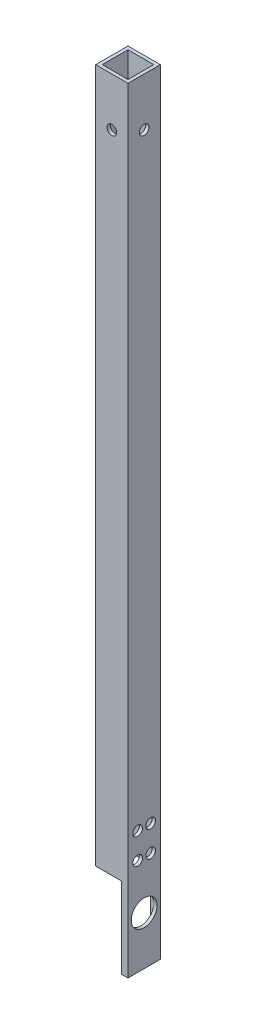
from build123d import *

# Parameters (mm, degrees)
SKETCH_1_W          = 10
SKETCH_1_H          = 10
SKETCH_1_W_2        = 8
SKETCH_1_H_2        = 8
EXTRUDE_1_DEPTH     = 240
CUT_EXTRUDE_1_REACH = 242.26
SKETCH_2_R          = 1.5
CUT_EXTRUDE_2_REACH = 242.26
SKETCH_3_R          = 1.5
CUT_EXTRUDE_3_REACH = 242.26
SKETCH_4_R          = 1.5
CUT_EXTRUDE_4_REACH = 242.26
SKETCH_5_R          = 3
CUT_EXTRUDE_5_REACH = 242.26
SKETCH_6_R          = 1.5
SKETCH_7_R          = 4
CUT_EXTRUDE_6_DEPTH = 1
SKETCH_8_W          = 10
SKETCH_8_H          = 25
CUT_EXTRUDE_7_DEPTH = 8


with BuildPart() as part:
    # Sketch 1 → Extrude 1 (new body)
    with BuildSketch(Plane(origin=(0, 0, 0), x_dir=(1, 0, 0), z_dir=(0, 1, 0))):
        Rectangle(SKETCH_1_W, SKETCH_1_H)
        Rectangle(SKETCH_1_W_2, SKETCH_1_H_2, mode=Mode.SUBTRACT)
    extrude(amount=EXTRUDE_1_DEPTH)

    # Cut-Extrude 1: up to this face of the body (flat: up to its plane)
    cut_extrude_1_end = Plane(part.part.faces().sort_by_distance((0, 120, -5))[0])
    # Sketch 2 → Cut-Extrude 1 (cut, up to the picked face)
    with BuildSketch(Plane.XY.offset(5), mode=Mode.PRIVATE) as cut_extrude_1_sk1:
        with Locations((0, 225)):
            Circle(SKETCH_2_R)
    cut_extrude_1_tool1 = split(extrude(cut_extrude_1_sk1.sketch, amount=-CUT_EXTRUDE_1_REACH, mode=Mode.PRIVATE), bisect_by=cut_extrude_1_end, keep=Keep.BOTH, mode=Mode.PRIVATE)
    add(cut_extrude_1_tool1.solids().sort_by(Axis((0, 225, 5), (0, 0, -1)))[0], mode=Mode.SUBTRACT)

    # Cut-Extrude 2: up to this face of the body (flat: up to its plane)
    cut_extrude_2_end = Plane(part.part.faces().sort_by_distance((-5, 120, 0))[0])
    # Sketch 3 → Cut-Extrude 2 (cut, up to the picked face)
    with BuildSketch(Plane(origin=(5, 0, 0), x_dir=(0, 0, -1), z_dir=(1, 0, 0)), mode=Mode.PRIVATE) as cut_extrude_2_sk1:
        with Locations((0, 225)):
            Circle(SKETCH_3_R)
    cut_extrude_2_tool1 = split(extrude(cut_extrude_2_sk1.sketch, amount=-CUT_EXTRUDE_2_REACH, mode=Mode.PRIVATE), bisect_by=cut_extrude_2_end, keep=Keep.BOTH, mode=Mode.PRIVATE)
    add(cut_extrude_2_tool1.solids().sort_by(Axis((5, 225, 0), (-1, 0, 0)))[0], mode=Mode.SUBTRACT)

    # Cut-Extrude 3: up to this face of the body (flat: up to its plane)
    cut_extrude_3_end = Plane(part.part.faces().sort_by_distance((0, 119.689835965, -5))[0])
    # Sketch 4 → Cut-Extrude 3 (cut, up to the picked face)
    with BuildSketch(Plane.XY.offset(5), mode=Mode.PRIVATE) as cut_extrude_3_sk1:
        with Locations((0, 8)):
            Circle(SKETCH_4_R)
    cut_extrude_3_tool1 = split(extrude(cut_extrude_3_sk1.sketch, amount=-CUT_EXTRUDE_3_REACH, mode=Mode.PRIVATE), bisect_by=cut_extrude_3_end, keep=Keep.BOTH, mode=Mode.PRIVATE)
    add(cut_extrude_3_tool1.solids().sort_by(Axis((0, 8, 5), (0, 0, -1)))[0], mode=Mode.SUBTRACT)

    # Cut-Extrude 4: up to this face of the body (flat: up to its plane)
    cut_extrude_4_end = Plane(part.part.faces().sort_by_distance((5, 119.689835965, 0))[0])
    # Sketch 5 → Cut-Extrude 4 (cut, up to the picked face)
    with BuildSketch(Plane.ZY.offset(5), mode=Mode.PRIVATE) as cut_extrude_4_sk1:
        with Locations((0, 15)):
            Circle(SKETCH_5_R)
    cut_extrude_4_tool1 = split(extrude(cut_extrude_4_sk1.sketch, amount=-CUT_EXTRUDE_4_REACH, mode=Mode.PRIVATE), bisect_by=cut_extrude_4_end, keep=Keep.BOTH, mode=Mode.PRIVATE)
    add(cut_extrude_4_tool1.solids().sort_by(Axis((-5, 15, 0), (1, 0, 0)))[0], mode=Mode.SUBTRACT)

    # Cut-Extrude 5: up to this face of the body (flat: up to its plane)
    cut_extrude_5_end = Plane(part.part.faces().sort_by_distance((-5, 120.941618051, 0))[0])
    # Sketch 6 → Cut-Extrude 5 (cut, up to the picked face)
    with BuildSketch(Plane(origin=(5, 0, 0), x_dir=(0, 0, -1), z_dir=(1, 0, 0)), mode=Mode.PRIVATE) as cut_extrude_5_sk1:
        with Locations((2, 30)):
            Circle(SKETCH_6_R)
    cut_extrude_5_tool1 = split(extrude(cut_extrude_5_sk1.sketch, amount=-CUT_EXTRUDE_5_REACH, mode=Mode.PRIVATE), bisect_by=cut_extrude_5_end, keep=Keep.BOTH, mode=Mode.PRIVATE)
    # Sketch 6 → Cut-Extrude 5 (cut, up to the picked face)
    with BuildSketch(Plane(origin=(5, 0, 0), x_dir=(0, 0, -1), z_dir=(1, 0, 0)), mode=Mode.PRIVATE) as cut_extrude_5_sk2:
        with Locations((-2, 30)):
            Circle(SKETCH_6_R)
    cut_extrude_5_tool2 = split(extrude(cut_extrude_5_sk2.sketch, amount=-CUT_EXTRUDE_5_REACH, mode=Mode.PRIVATE), bisect_by=cut_extrude_5_end, keep=Keep.BOTH, mode=Mode.PRIVATE)
    # Sketch 6 → Cut-Extrude 5 (cut, up to the picked face)
    with BuildSketch(Plane(origin=(5, 0, 0), x_dir=(0, 0, -1), z_dir=(1, 0, 0)), mode=Mode.PRIVATE) as cut_extrude_5_sk3:
        with Locations((2, 38)):
            Circle(SKETCH_6_R)
    cut_extrude_5_tool3 = split(extrude(cut_extrude_5_sk3.sketch, amount=-CUT_EXTRUDE_5_REACH, mode=Mode.PRIVATE), bisect_by=cut_extrude_5_end, keep=Keep.BOTH, mode=Mode.PRIVATE)
    # Sketch 6 → Cut-Extrude 5 (cut, up to the picked face)
    with BuildSketch(Plane(origin=(5, 0, 0), x_dir=(0, 0, -1), z_dir=(1, 0, 0)), mode=Mode.PRIVATE) as cut_extrude_5_sk4:
        with Locations((-2, 38)):
            Circle(SKETCH_6_R)
    cut_extrude_5_tool4 = split(extrude(cut_extrude_5_sk4.sketch, amount=-CUT_EXTRUDE_5_REACH, mode=Mode.PRIVATE), bisect_by=cut_extrude_5_end, keep=Keep.BOTH, mode=Mode.PRIVATE)
    add(cut_extrude_5_tool1.solids().sort_by(Axis((5, 30, -2), (-1, 0, 0)))[0], mode=Mode.SUBTRACT)
    add(cut_extrude_5_tool2.solids().sort_by(Axis((5, 30, 2), (-1, 0, 0)))[0], mode=Mode.SUBTRACT)
    add(cut_extrude_5_tool3.solids().sort_by(Axis((5, 38, -2), (-1, 0, 0)))[0], mode=Mode.SUBTRACT)
    add(cut_extrude_5_tool4.solids().sort_by(Axis((5, 38, 2), (-1, 0, 0)))[0], mode=Mode.SUBTRACT)

    # Sketch 7 → Cut-Extrude 6 (cut)
    with BuildSketch(Plane(origin=(5, 0, 0), x_dir=(0, 0, -1), z_dir=(1, 0, 0))):
        with Locations((0, 15)):
            Circle(SKETCH_7_R)
    extrude(amount=-CUT_EXTRUDE_6_DEPTH, mode=Mode.SUBTRACT)

    # Sketch 8 → Cut-Extrude 7 (cut)
    with BuildSketch(Plane.ZY.offset(5)):
        with Locations((0, 12.5)):
            Rectangle(SKETCH_8_W, SKETCH_8_H)
    extrude(amount=-CUT_EXTRUDE_7_DEPTH, mode=Mode.SUBTRACT)


solid = part.part
